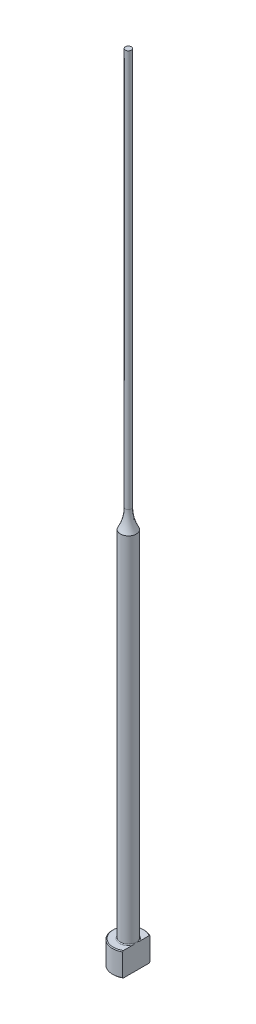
from build123d import *
from build123d.topology import SkipClean

# Parameters (mm, degrees)
CHAMFER1_SIZE    = 0.2
FILLET1_R        = 0.2
KEYED_HEAD_DEPTH = 201.079984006


with BuildPart() as part:
    # Sketch1 → Revolve1 (revolve)
    with BuildSketch(Plane.XY, mode=Mode.PRIVATE) as revolve1_sk:
        with BuildLine():
            Line((0, 0), (-4, 0))
            Line((-4, 0), (-4, 6))
            Line((-4, 6), (-2, 6))
            Line((-2, 6), (-2, 95.158770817))
            ThreePointArc((-2, 95.158770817), (-1.067541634, 97.5), (-0.75, 100))
            Line((-0.75, 100), (-0.75, 200))
            Line((-0.75, 200), (0, 200))
            Line((0, 200), (0, 0))
        make_face()
    revolve(revolve1_sk.sketch.rotate(Axis((0, 259.958771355, 0), (0, -1, 0)), 270), axis=Axis((0, 259.958771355, 0), (0, -1, 0)))

    # Chamfer1
    chamfer1_edges = [part.edges().sort_by_distance(p)[0] for p in [
        (0, 0, -4),
        (0, 6, -4),
    ]]
    chamfer(chamfer1_edges, length=CHAMFER1_SIZE)

    # Fillet1
    fillet1_edges = [part.edges().sort_by_distance(p)[0] for p in [
        (0, 6, -2),
    ]]
    fillet(fillet1_edges, radius=FILLET1_R)

    # Sketch2 → Keyed Head (cut, through all)
    with SkipClean():  # the faces are left unmerged after this step: merging them gives an invalid solid
        with BuildSketch(Plane(origin=(0, 0, 0), x_dir=(1, 0, 0), z_dir=(0, 1, 0))):
            with BuildLine():
                Line((2, -3.464101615), (2, 3.464101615))
                ThreePointArc((2, 3.464101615), (4, 0), (2, -3.464101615))
            make_face()
        extrude(amount=KEYED_HEAD_DEPTH, mode=Mode.SUBTRACT)


solid = part.part
